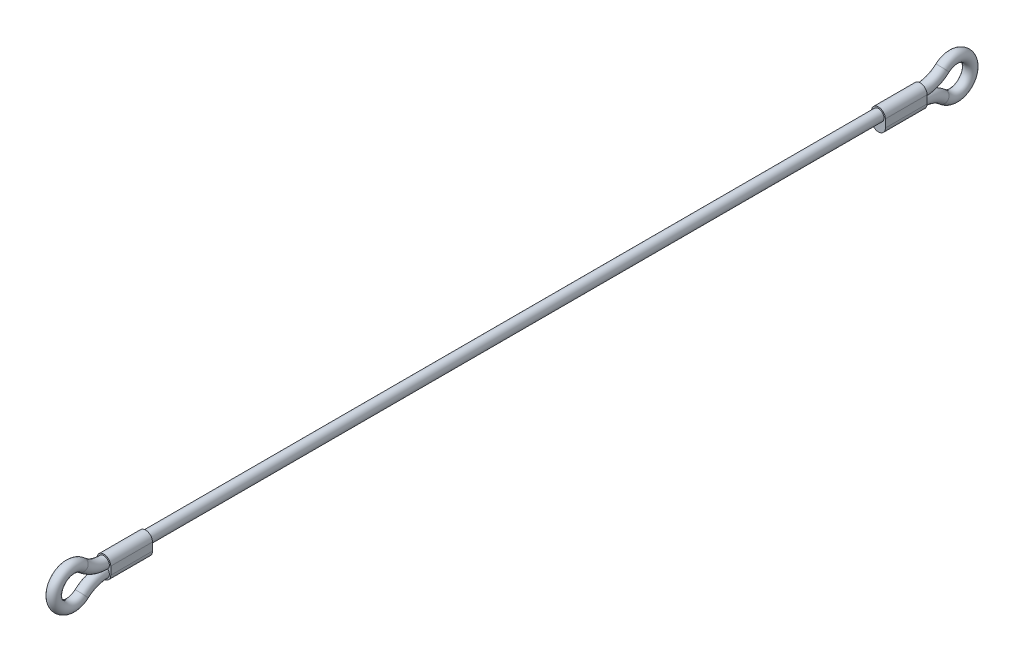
ISO-10303-21;
HEADER;
FILE_DESCRIPTION(('STEP AP214'),'2;1');
FILE_NAME('part.step','',(''),(''),'','','');
FILE_SCHEMA(('AUTOMOTIVE_DESIGN { 1 0 10303 214 1 1 1 1 }'));
ENDSEC;
DATA;
#1=APPLICATION_CONTEXT('core data for automotive mechanical design processes');
#2=APPLICATION_PROTOCOL_DEFINITION('international standard','automotive_design',2000,#1);
#3=PRODUCT_CONTEXT('',#1,'mechanical');
#4=PRODUCT('Part','Part','',(#3));
#5=PRODUCT_RELATED_PRODUCT_CATEGORY('part','',(#4));
#6=PRODUCT_DEFINITION_FORMATION('','',#4);
#7=PRODUCT_DEFINITION_CONTEXT('part definition',#1,'design');
#8=PRODUCT_DEFINITION('design','',#6,#7);
#9=PRODUCT_DEFINITION_SHAPE('','',#8);
#10=(LENGTH_UNIT() NAMED_UNIT(*) SI_UNIT(.MILLI.,.METRE.));
#11=(NAMED_UNIT(*) PLANE_ANGLE_UNIT() SI_UNIT($,.RADIAN.));
#12=(NAMED_UNIT(*) SI_UNIT($,.STERADIAN.) SOLID_ANGLE_UNIT());
#13=UNCERTAINTY_MEASURE_WITH_UNIT(LENGTH_MEASURE(1.E-05),#10,'distance_accuracy_value','');
#14=(GEOMETRIC_REPRESENTATION_CONTEXT(3) GLOBAL_UNCERTAINTY_ASSIGNED_CONTEXT((#13)) GLOBAL_UNIT_ASSIGNED_CONTEXT((#10,
#11,#12)) REPRESENTATION_CONTEXT('',''));
#15=CARTESIAN_POINT('',(0.,0.,0.));
#16=DIRECTION('',(0.,0.,1.));
#17=DIRECTION('',(1.,0.,0.));
#18=AXIS2_PLACEMENT_3D('',#15,#16,#17);
#19=CARTESIAN_POINT('',(0.,0.,-117.4));
#20=DIRECTION('',(0.,0.,1.));
#21=DIRECTION('',(1.,0.,0.));
#22=AXIS2_PLACEMENT_3D('',#19,#20,#21);
#23=CYLINDRICAL_SURFACE('',#22,1.59);
#24=CARTESIAN_POINT('',(0.,0.,-105.4));
#25=DIRECTION('',(0.,0.,1.));
#26=DIRECTION('',(0.,-1.,0.));
#27=AXIS2_PLACEMENT_3D('',#24,#25,#26);
#28=CIRCLE('',#27,1.59);
#29=CARTESIAN_POINT('',(0.,-1.59,-105.4));
#30=VERTEX_POINT('',#29);
#31=EDGE_CURVE('E11',#30,#30,#28,.F.);
#32=ORIENTED_EDGE('',*,*,#31,.F.);
#33=EDGE_LOOP('',(#32));
#34=FACE_BOUND('',#33,.T.);
#35=CARTESIAN_POINT('',(0.,0.,105.4));
#36=DIRECTION('',(0.,0.,-1.));
#37=DIRECTION('',(0.,1.,0.));
#38=AXIS2_PLACEMENT_3D('',#35,#36,#37);
#39=CIRCLE('',#38,1.59);
#40=CARTESIAN_POINT('',(0.,1.59,105.4));
#41=VERTEX_POINT('',#40);
#42=EDGE_CURVE('E51',#41,#41,#39,.F.);
#43=ORIENTED_EDGE('',*,*,#42,.F.);
#44=EDGE_LOOP('',(#43));
#45=FACE_BOUND('',#44,.T.);
#46=ADVANCED_FACE('F41',(#34,#45),#23,.T.);
#47=CARTESIAN_POINT('',(0.,1.15648231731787E-13,105.4));
#48=DIRECTION('',(0.,0.,1.));
#49=DIRECTION('',(0.,-1.,0.));
#50=AXIS2_PLACEMENT_3D('',#47,#48,#49);
#51=CYLINDRICAL_SURFACE('',#50,1.995);
#52=CARTESIAN_POINT('',(0.,1.32995466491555E-13,117.4));
#53=DIRECTION('',(0.,0.,-1.));
#54=DIRECTION('',(0.,1.,0.));
#55=AXIS2_PLACEMENT_3D('',#52,#53,#54);
#56=CIRCLE('',#55,1.995);
#57=CARTESIAN_POINT('',(-1.995,1.33239783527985E-13,117.4));
#58=VERTEX_POINT('',#57);
#59=CARTESIAN_POINT('',(1.995,1.32751149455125E-13,117.4));
#60=VERTEX_POINT('',#59);
#61=EDGE_CURVE('E134',#58,#60,#56,.T.);
#62=ORIENTED_EDGE('',*,*,#61,.T.);
#63=DIRECTION('',(0.,0.,1.));
#64=VECTOR('',#63,1.);
#65=CARTESIAN_POINT('',(1.995,1.15403914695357E-13,105.4));
#66=LINE('',#65,#64);
#67=CARTESIAN_POINT('',(1.995,1.15403914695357E-13,105.4));
#68=VERTEX_POINT('',#67);
#69=EDGE_CURVE('E214',#68,#60,#66,.T.);
#70=ORIENTED_EDGE('',*,*,#69,.F.);
#71=CARTESIAN_POINT('',(0.,1.15648231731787E-13,105.4));
#72=DIRECTION('',(0.,0.,-1.));
#73=DIRECTION('',(0.,1.,0.));
#74=AXIS2_PLACEMENT_3D('',#71,#72,#73);
#75=CIRCLE('',#74,1.995);
#76=CARTESIAN_POINT('',(-1.995,1.15892548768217E-13,105.4));
#77=VERTEX_POINT('',#76);
#78=EDGE_CURVE('E179',#77,#68,#75,.T.);
#79=ORIENTED_EDGE('',*,*,#78,.F.);
#80=DIRECTION('',(0.,0.,1.));
#81=VECTOR('',#80,1.);
#82=CARTESIAN_POINT('',(-1.995,1.15892548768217E-13,105.4));
#83=LINE('',#82,#81);
#84=EDGE_CURVE('E192',#77,#58,#83,.T.);
#85=ORIENTED_EDGE('',*,*,#84,.T.);
#86=EDGE_LOOP('',(#62,#70,#79,#85));
#87=FACE_BOUND('',#86,.T.);
#88=ADVANCED_FACE('F278',(#87),#51,.T.);
#89=CARTESIAN_POINT('',(1.995,1.15403914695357E-13,105.4));
#90=DIRECTION('',(-1.,0.,0.));
#91=DIRECTION('',(0.,0.,1.));
#92=AXIS2_PLACEMENT_3D('',#89,#90,#91);
#93=PLANE('',#92);
#94=DIRECTION('',(0.,-1.,0.));
#95=VECTOR('',#94,1.);
#96=CARTESIAN_POINT('',(1.995,1.32751149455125E-13,117.4));
#97=LINE('',#96,#95);
#98=CARTESIAN_POINT('',(1.995,-2.26625258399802,117.4));
#99=VERTEX_POINT('',#98);
#100=EDGE_CURVE('E196',#60,#99,#97,.T.);
#101=ORIENTED_EDGE('',*,*,#100,.T.);
#102=DIRECTION('',(0.,0.,1.));
#103=VECTOR('',#102,1.);
#104=CARTESIAN_POINT('',(1.995,-2.26625258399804,105.4));
#105=LINE('',#104,#103);
#106=CARTESIAN_POINT('',(1.995,-2.26625258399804,105.4));
#107=VERTEX_POINT('',#106);
#108=EDGE_CURVE('E211',#107,#99,#105,.T.);
#109=ORIENTED_EDGE('',*,*,#108,.F.);
#110=DIRECTION('',(0.,-1.,0.));
#111=VECTOR('',#110,1.);
#112=CARTESIAN_POINT('',(1.995,1.15403914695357E-13,105.4));
#113=LINE('',#112,#111);
#114=EDGE_CURVE('E183',#68,#107,#113,.T.);
#115=ORIENTED_EDGE('',*,*,#114,.F.);
#116=ORIENTED_EDGE('',*,*,#69,.T.);
#117=EDGE_LOOP('',(#101,#109,#115,#116));
#118=FACE_BOUND('',#117,.T.);
#119=ADVANCED_FACE('F283',(#118),#93,.F.);
#120=CARTESIAN_POINT('',(0.,-2.26625258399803,105.4));
#121=DIRECTION('',(0.,0.,1.));
#122=DIRECTION('',(0.,-1.,0.));
#123=AXIS2_PLACEMENT_3D('',#120,#121,#122);
#124=CYLINDRICAL_SURFACE('',#123,1.995);
#125=CARTESIAN_POINT('',(0.,-2.26625258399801,117.4));
#126=DIRECTION('',(0.,0.,-1.));
#127=DIRECTION('',(0.,1.,0.));
#128=AXIS2_PLACEMENT_3D('',#125,#126,#127);
#129=CIRCLE('',#128,1.995);
#130=CARTESIAN_POINT('',(-1.995,-2.26625258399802,117.4));
#131=VERTEX_POINT('',#130);
#132=EDGE_CURVE('E199',#99,#131,#129,.T.);
#133=ORIENTED_EDGE('',*,*,#132,.T.);
#134=DIRECTION('',(0.,0.,1.));
#135=VECTOR('',#134,1.);
#136=CARTESIAN_POINT('',(-1.995,-2.26625258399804,105.4));
#137=LINE('',#136,#135);
#138=CARTESIAN_POINT('',(-1.995,-2.26625258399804,105.4));
#139=VERTEX_POINT('',#138);
#140=EDGE_CURVE('E207',#139,#131,#137,.T.);
#141=ORIENTED_EDGE('',*,*,#140,.F.);
#142=CARTESIAN_POINT('',(0.,-2.26625258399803,105.4));
#143=DIRECTION('',(0.,0.,-1.));
#144=DIRECTION('',(0.,1.,0.));
#145=AXIS2_PLACEMENT_3D('',#142,#143,#144);
#146=CIRCLE('',#145,1.995);
#147=EDGE_CURVE('E187',#107,#139,#146,.T.);
#148=ORIENTED_EDGE('',*,*,#147,.F.);
#149=ORIENTED_EDGE('',*,*,#108,.T.);
#150=EDGE_LOOP('',(#133,#141,#148,#149));
#151=FACE_BOUND('',#150,.T.);
#152=ADVANCED_FACE('F324',(#151),#124,.T.);
#153=CARTESIAN_POINT('',(-1.995,1.15892548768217E-13,105.4));
#154=DIRECTION('',(1.,0.,0.));
#155=DIRECTION('',(0.,1.,0.));
#156=AXIS2_PLACEMENT_3D('',#153,#154,#155);
#157=PLANE('',#156);
#158=DIRECTION('',(0.,1.,0.));
#159=VECTOR('',#158,1.);
#160=CARTESIAN_POINT('',(-1.995,1.33239783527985E-13,117.4));
#161=LINE('',#160,#159);
#162=EDGE_CURVE('E184',#131,#58,#161,.T.);
#163=ORIENTED_EDGE('',*,*,#162,.T.);
#164=ORIENTED_EDGE('',*,*,#84,.F.);
#165=DIRECTION('',(0.,1.,0.));
#166=VECTOR('',#165,1.);
#167=CARTESIAN_POINT('',(-1.995,1.15892548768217E-13,105.4));
#168=LINE('',#167,#166);
#169=EDGE_CURVE('E189',#139,#77,#168,.T.);
#170=ORIENTED_EDGE('',*,*,#169,.F.);
#171=ORIENTED_EDGE('',*,*,#140,.T.);
#172=EDGE_LOOP('',(#163,#164,#170,#171));
#173=FACE_BOUND('',#172,.T.);
#174=ADVANCED_FACE('F320',(#173),#157,.F.);
#175=CARTESIAN_POINT('',(0.,1.15648231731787E-13,105.4));
#176=DIRECTION('',(0.,0.,-1.));
#177=DIRECTION('',(0.,1.,0.));
#178=AXIS2_PLACEMENT_3D('',#175,#176,#177);
#179=PLANE('',#178);
#180=ORIENTED_EDGE('',*,*,#42,.T.);
#181=EDGE_LOOP('',(#180));
#182=FACE_BOUND('',#181,.T.);
#183=ORIENTED_EDGE('',*,*,#78,.T.);
#184=ORIENTED_EDGE('',*,*,#114,.T.);
#185=ORIENTED_EDGE('',*,*,#147,.T.);
#186=ORIENTED_EDGE('',*,*,#169,.T.);
#187=EDGE_LOOP('',(#183,#184,#185,#186));
#188=FACE_BOUND('',#187,.T.);
#189=ADVANCED_FACE('F272',(#182,#188),#179,.T.);
#190=CARTESIAN_POINT('',(0.,1.32995466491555E-13,117.4));
#191=DIRECTION('',(0.,0.,-1.));
#192=DIRECTION('',(0.,1.,0.));
#193=AXIS2_PLACEMENT_3D('',#190,#191,#192);
#194=PLANE('',#193);
#195=CARTESIAN_POINT('',(0.,0.,117.4));
#196=DIRECTION('',(0.,0.,1.));
#197=DIRECTION('',(1.,0.,0.));
#198=AXIS2_PLACEMENT_3D('',#195,#196,#197);
#199=CIRCLE('',#198,1.59);
#200=CARTESIAN_POINT('',(1.1154034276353,-1.13312629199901,117.4));
#201=VERTEX_POINT('',#200);
#202=CARTESIAN_POINT('',(-1.1154034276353,-1.13312629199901,117.4));
#203=VERTEX_POINT('',#202);
#204=EDGE_CURVE('E231',#201,#203,#199,.T.);
#205=ORIENTED_EDGE('',*,*,#204,.F.);
#206=CARTESIAN_POINT('',(0.,-2.26625258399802,117.4));
#207=DIRECTION('',(0.,0.,-1.));
#208=DIRECTION('',(1.,0.,0.));
#209=AXIS2_PLACEMENT_3D('',#206,#207,#208);
#210=CIRCLE('',#209,1.59);
#211=EDGE_CURVE('E64',#201,#203,#210,.T.);
#212=ORIENTED_EDGE('',*,*,#211,.T.);
#213=EDGE_LOOP('',(#205,#212));
#214=FACE_BOUND('',#213,.T.);
#215=ORIENTED_EDGE('',*,*,#61,.F.);
#216=ORIENTED_EDGE('',*,*,#162,.F.);
#217=ORIENTED_EDGE('',*,*,#132,.F.);
#218=ORIENTED_EDGE('',*,*,#100,.F.);
#219=EDGE_LOOP('',(#215,#216,#217,#218));
#220=FACE_BOUND('',#219,.T.);
#221=ADVANCED_FACE('F266',(#214,#220),#194,.F.);
#222=CARTESIAN_POINT('',(0.,-1.13312629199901,127.));
#223=DIRECTION('',(1.,0.,0.));
#224=DIRECTION('',(0.,0.,-1.));
#225=AXIS2_PLACEMENT_3D('',#222,#223,#224);
#226=TOROIDAL_SURFACE('',#225,4.80000000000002,1.59);
#227=CARTESIAN_POINT('',(0.,2.44458247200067,123.8));
#228=DIRECTION('',(0.,0.666666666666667,0.74535599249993));
#229=DIRECTION('',(1.,0.,0.));
#230=AXIS2_PLACEMENT_3D('',#227,#228,#229);
#231=CIRCLE('',#230,1.59);
#232=CARTESIAN_POINT('',(0.,3.62969850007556,122.74));
#233=VERTEX_POINT('',#232);
#234=EDGE_CURVE('E234',#233,#233,#231,.T.);
#235=CARTESIAN_POINT('',(0.,-4.71083505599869,123.8));
#236=DIRECTION('',(0.,0.666666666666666,-0.74535599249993));
#237=DIRECTION('',(1.,0.,0.));
#238=AXIS2_PLACEMENT_3D('',#235,#236,#237);
#239=CIRCLE('',#238,1.59);
#240=CARTESIAN_POINT('',(0.,-5.89595108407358,122.74));
#241=VERTEX_POINT('',#240);
#242=EDGE_CURVE('E238',#241,#241,#239,.T.);
#243=CARTESIAN_POINT('',(0.,-1.13312629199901,127.));
#244=DIRECTION('',(1.,0.,0.));
#245=DIRECTION('',(0.,0.,-1.));
#246=AXIS2_PLACEMENT_3D('',#243,#244,#245);
#247=CIRCLE('',#246,6.39000000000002);
#248=EDGE_CURVE('',#233,#241,#247,.T.);
#249=ORIENTED_EDGE('',*,*,#234,.T.);
#250=ORIENTED_EDGE('',*,*,#242,.F.);
#251=ORIENTED_EDGE('',*,*,#248,.T.);
#252=ORIENTED_EDGE('',*,*,#248,.F.);
#253=EDGE_LOOP('',(#249,#251,#250,#252));
#254=FACE_BOUND('',#253,.T.);
#255=ADVANCED_FACE('F264',(#254),#226,.T.);
#256=CARTESIAN_POINT('',(0.,-11.866252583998,117.4));
#257=DIRECTION('',(-1.,0.,0.));
#258=DIRECTION('',(0.,0.,1.));
#259=AXIS2_PLACEMENT_3D('',#256,#257,#258);
#260=TOROIDAL_SURFACE('',#259,9.59999999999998,1.59);
#261=CARTESIAN_POINT('',(-1.1154034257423,-1.13312629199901,117.3998));
#262=CARTESIAN_POINT('',(-1.11534851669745,-1.13312629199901,117.52773673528));
#263=CARTESIAN_POINT('',(-1.11308141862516,-1.13312629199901,117.655686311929));
#264=CARTESIAN_POINT('',(-1.10371453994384,-1.13312629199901,117.91155828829));
#265=CARTESIAN_POINT('',(-1.09660901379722,-1.13312629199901,118.03948047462));
#266=CARTESIAN_POINT('',(-1.07704253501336,-1.13312629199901,118.296418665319));
#267=CARTESIAN_POINT('',(-1.0645205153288,-1.13312629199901,118.425430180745));
#268=CARTESIAN_POINT('',(-1.03319430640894,-1.13312629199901,118.682627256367));
#269=CARTESIAN_POINT('',(-1.01439338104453,-1.13312629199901,118.810813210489));
#270=CARTESIAN_POINT('',(-0.966908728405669,-1.13312629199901,119.078005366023));
#271=CARTESIAN_POINT('',(-0.937456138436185,-1.13312629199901,119.216883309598));
#272=CARTESIAN_POINT('',(-0.883915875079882,-1.13312629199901,119.42263125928));
#273=CARTESIAN_POINT('',(-0.864530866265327,-1.13312629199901,119.490724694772));
#274=CARTESIAN_POINT('',(-0.821996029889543,-1.13312629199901,119.625715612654));
#275=CARTESIAN_POINT('',(-0.798847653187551,-1.13312629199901,119.692613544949));
#276=CARTESIAN_POINT('',(-0.744519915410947,-1.13312629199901,119.833542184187));
#277=CARTESIAN_POINT('',(-0.712679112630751,-1.13312629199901,119.907321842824));
#278=CARTESIAN_POINT('',(-0.64127940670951,-1.13312629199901,120.051146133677));
#279=CARTESIAN_POINT('',(-0.601727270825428,-1.13312629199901,120.121193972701));
#280=CARTESIAN_POINT('',(-0.528948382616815,-1.13312629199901,120.22943568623));
#281=CARTESIAN_POINT('',(-0.498892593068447,-1.13312629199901,120.269741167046));
#282=CARTESIAN_POINT('',(-0.433770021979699,-1.13312629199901,120.3461405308));
#283=CARTESIAN_POINT('',(-0.398710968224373,-1.13312629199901,120.382240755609));
#284=CARTESIAN_POINT('',(-0.335060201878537,-1.13312629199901,120.437058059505));
#285=CARTESIAN_POINT('',(-0.308066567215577,-1.13312629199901,120.457612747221));
#286=CARTESIAN_POINT('',(-0.251279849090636,-1.13312629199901,120.494433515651));
#287=CARTESIAN_POINT('',(-0.221491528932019,-1.13312629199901,120.510706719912));
#288=CARTESIAN_POINT('',(-0.165682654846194,-1.13312629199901,120.534797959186));
#289=CARTESIAN_POINT('',(-0.140117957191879,-1.13312629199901,120.543660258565));
#290=CARTESIAN_POINT('',(-0.0878641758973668,-1.13312629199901,120.556990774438));
#291=CARTESIAN_POINT('',(-0.0611762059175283,-1.13312629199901,120.561463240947));
#292=CARTESIAN_POINT('',(-0.00731772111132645,-1.13312629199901,120.565572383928));
#293=CARTESIAN_POINT('',(0.0198542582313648,-1.13312629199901,120.565190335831));
#294=CARTESIAN_POINT('',(0.0736951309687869,-1.13312629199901,120.559586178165));
#295=CARTESIAN_POINT('',(0.100363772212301,-1.13312629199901,120.554361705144));
#296=CARTESIAN_POINT('',(0.151195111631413,-1.13312629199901,120.539957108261));
#297=CARTESIAN_POINT('',(0.175416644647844,-1.13312629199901,120.530979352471));
#298=CARTESIAN_POINT('',(0.222373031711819,-1.13312629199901,120.509774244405));
#299=CARTESIAN_POINT('',(0.245107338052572,-1.13312629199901,120.497545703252));
#300=CARTESIAN_POINT('',(0.304759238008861,-1.13312629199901,120.460748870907));
#301=CARTESIAN_POINT('',(0.340101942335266,-1.13312629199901,120.433635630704));
#302=CARTESIAN_POINT('',(0.406281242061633,-1.13312629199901,120.37436880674));
#303=CARTESIAN_POINT('',(0.437102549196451,-1.13312629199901,120.342198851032));
#304=CARTESIAN_POINT('',(0.492718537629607,-1.13312629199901,120.27701365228));
#305=CARTESIAN_POINT('',(0.517788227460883,-1.13312629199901,120.244229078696));
#306=CARTESIAN_POINT('',(0.565060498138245,-1.13312629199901,120.176639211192));
#307=CARTESIAN_POINT('',(0.587260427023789,-1.13312629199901,120.141832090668));
#308=CARTESIAN_POINT('',(0.650275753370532,-1.13312629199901,120.035150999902));
#309=CARTESIAN_POINT('',(0.687428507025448,-1.13312629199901,119.961116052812));
#310=CARTESIAN_POINT('',(0.745434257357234,-1.13312629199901,119.830275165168));
#311=CARTESIAN_POINT('',(0.767985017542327,-1.13312629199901,119.774182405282));
#312=CARTESIAN_POINT('',(0.809859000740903,-1.13312629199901,119.660796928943));
#313=CARTESIAN_POINT('',(0.829181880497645,-1.13312629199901,119.603504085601));
#314=CARTESIAN_POINT('',(0.883166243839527,-1.13312629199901,119.430173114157));
#315=CARTESIAN_POINT('',(0.913763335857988,-1.13312629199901,119.312874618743));
#316=CARTESIAN_POINT('',(0.967023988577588,-1.13312629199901,119.075955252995));
#317=CARTESIAN_POINT('',(0.989647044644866,-1.13312629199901,118.956325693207));
#318=CARTESIAN_POINT('',(1.02845868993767,-1.13312629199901,118.716012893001));
#319=CARTESIAN_POINT('',(1.04464572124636,-1.13312629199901,118.595329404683));
#320=CARTESIAN_POINT('',(1.06818793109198,-1.13312629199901,118.38453669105));
#321=CARTESIAN_POINT('',(1.07674400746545,-1.13312629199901,118.294556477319));
#322=CARTESIAN_POINT('',(1.09119671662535,-1.13312629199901,118.114367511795));
#323=CARTESIAN_POINT('',(1.0970928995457,-1.13312629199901,118.024158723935));
#324=CARTESIAN_POINT('',(1.10635885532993,-1.13312629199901,117.844939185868));
#325=CARTESIAN_POINT('',(1.10976438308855,-1.13312629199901,117.755930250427));
#326=CARTESIAN_POINT('',(1.11428069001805,-1.13312629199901,117.577880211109));
#327=CARTESIAN_POINT('',(1.1153921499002,-1.13312629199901,117.488839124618));
#328=CARTESIAN_POINT('',(1.11540342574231,-1.13312629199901,117.3998));
#329=B_SPLINE_CURVE_WITH_KNOTS('',3,(#261,#262,#263,#264,#265,#266,#267,#268,#269,#270,#271,
#272,#273,#274,#275,#276,#277,#278,#279,#280,#281,#282,#283,#284,#285,#286,#287,#288,#289,#290,
#291,#292,#293,#294,#295,#296,#297,#298,#299,#300,#301,#302,#303,#304,#305,#306,#307,#308,#309,
#310,#311,#312,#313,#314,#315,#316,#317,#318,#319,#320,#321,#322,#323,#324,#325,#326,#327,#328),
.UNSPECIFIED.,.F.,.F.,(4,2,2,2,2,2,2,2,2,2,2,2,2,2,2,2,2,2,2,2,2,2,2,2,2,2,2,2,2,2,2,2,2,4),(0.,
0.383810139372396,0.768076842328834,1.15679365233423,1.54530871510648,1.9707126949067,
2.18302701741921,2.39525968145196,2.6360416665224,2.87661329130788,3.02716706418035,
3.17749076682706,3.2789882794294,3.38031583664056,3.46115731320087,3.54192044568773,
3.62299518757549,3.70410952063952,3.78132200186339,3.85856276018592,3.99142265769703,
4.12472192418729,4.24834991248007,4.37209134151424,4.61994843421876,4.80123584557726,
4.98254252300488,5.34577733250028,5.71083149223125,6.07597396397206,6.34709439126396,
6.61826065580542,6.88545336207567,7.15256677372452),.UNSPECIFIED.);
#330=EDGE_CURVE('E244',#203,#201,#329,.T.);
#331=ORIENTED_EDGE('',*,*,#330,.F.);
#332=ORIENTED_EDGE('',*,*,#211,.F.);
#333=EDGE_LOOP('',(#331,#332));
#334=FACE_BOUND('',#333,.T.);
#335=ORIENTED_EDGE('',*,*,#242,.T.);
#336=EDGE_LOOP('',(#335));
#337=FACE_BOUND('',#336,.T.);
#338=ADVANCED_FACE('F43',(#334,#337),#260,.T.);
#339=CARTESIAN_POINT('',(0.,9.59999999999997,117.4));
#340=DIRECTION('',(-1.,0.,0.));
#341=DIRECTION('',(0.,0.,1.));
#342=AXIS2_PLACEMENT_3D('',#339,#340,#341);
#343=TOROIDAL_SURFACE('',#342,9.59999999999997,1.59);
#344=ORIENTED_EDGE('',*,*,#234,.F.);
#345=EDGE_LOOP('',(#344));
#346=FACE_BOUND('',#345,.T.);
#347=ORIENTED_EDGE('',*,*,#204,.T.);
#348=ORIENTED_EDGE('',*,*,#330,.T.);
#349=EDGE_LOOP('',(#347,#348));
#350=FACE_BOUND('',#349,.T.);
#351=ADVANCED_FACE('F259',(#346,#350),#343,.T.);
#352=CARTESIAN_POINT('',(0.,1.15648231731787E-13,-105.4));
#353=DIRECTION('',(0.,0.,-1.));
#354=DIRECTION('',(0.,1.,0.));
#355=AXIS2_PLACEMENT_3D('',#352,#353,#354);
#356=CYLINDRICAL_SURFACE('',#355,1.995);
#357=CARTESIAN_POINT('',(0.,1.32995466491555E-13,-117.4));
#358=DIRECTION('',(0.,0.,-1.));
#359=DIRECTION('',(0.,1.,0.));
#360=AXIS2_PLACEMENT_3D('',#357,#358,#359);
#361=CIRCLE('',#360,1.995);
#362=CARTESIAN_POINT('',(-1.995,1.33239783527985E-13,-117.4));
#363=VERTEX_POINT('',#362);
#364=CARTESIAN_POINT('',(1.995,1.32751149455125E-13,-117.4));
#365=VERTEX_POINT('',#364);
#366=EDGE_CURVE('E128',#363,#365,#361,.T.);
#367=ORIENTED_EDGE('',*,*,#366,.F.);
#368=DIRECTION('',(0.,0.,-1.));
#369=VECTOR('',#368,1.);
#370=CARTESIAN_POINT('',(-1.995,1.15892548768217E-13,-105.4));
#371=LINE('',#370,#369);
#372=CARTESIAN_POINT('',(-1.995,1.15892548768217E-13,-105.4));
#373=VERTEX_POINT('',#372);
#374=EDGE_CURVE('E122',#373,#363,#371,.T.);
#375=ORIENTED_EDGE('',*,*,#374,.F.);
#376=CARTESIAN_POINT('',(0.,1.15648231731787E-13,-105.4));
#377=DIRECTION('',(0.,0.,-1.));
#378=DIRECTION('',(0.,1.,0.));
#379=AXIS2_PLACEMENT_3D('',#376,#377,#378);
#380=CIRCLE('',#379,1.995);
#381=CARTESIAN_POINT('',(1.995,1.15403914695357E-13,-105.4));
#382=VERTEX_POINT('',#381);
#383=EDGE_CURVE('E125',#373,#382,#380,.T.);
#384=ORIENTED_EDGE('',*,*,#383,.T.);
#385=DIRECTION('',(0.,0.,-1.));
#386=VECTOR('',#385,1.);
#387=CARTESIAN_POINT('',(1.995,1.15403914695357E-13,-105.4));
#388=LINE('',#387,#386);
#389=EDGE_CURVE('E159',#382,#365,#388,.T.);
#390=ORIENTED_EDGE('',*,*,#389,.T.);
#391=EDGE_LOOP('',(#367,#375,#384,#390));
#392=FACE_BOUND('',#391,.T.);
#393=ADVANCED_FACE('F124',(#392),#356,.T.);
#394=CARTESIAN_POINT('',(-1.995,1.15892548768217E-13,-105.4));
#395=DIRECTION('',(-1.,0.,0.));
#396=DIRECTION('',(0.,-1.,0.));
#397=AXIS2_PLACEMENT_3D('',#394,#395,#396);
#398=PLANE('',#397);
#399=DIRECTION('',(0.,1.,0.));
#400=VECTOR('',#399,1.);
#401=CARTESIAN_POINT('',(-1.995,1.33239783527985E-13,-117.4));
#402=LINE('',#401,#400);
#403=CARTESIAN_POINT('',(-1.995,-2.26625258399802,-117.4));
#404=VERTEX_POINT('',#403);
#405=EDGE_CURVE('E162',#404,#363,#402,.T.);
#406=ORIENTED_EDGE('',*,*,#405,.F.);
#407=DIRECTION('',(0.,0.,-1.));
#408=VECTOR('',#407,1.);
#409=CARTESIAN_POINT('',(-1.995,-2.26625258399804,-105.4));
#410=LINE('',#409,#408);
#411=CARTESIAN_POINT('',(-1.995,-2.26625258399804,-105.4));
#412=VERTEX_POINT('',#411);
#413=EDGE_CURVE('E135',#412,#404,#410,.T.);
#414=ORIENTED_EDGE('',*,*,#413,.F.);
#415=DIRECTION('',(0.,1.,0.));
#416=VECTOR('',#415,1.);
#417=CARTESIAN_POINT('',(-1.995,1.15892548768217E-13,-105.4));
#418=LINE('',#417,#416);
#419=EDGE_CURVE('E141',#412,#373,#418,.T.);
#420=ORIENTED_EDGE('',*,*,#419,.T.);
#421=ORIENTED_EDGE('',*,*,#374,.T.);
#422=EDGE_LOOP('',(#406,#414,#420,#421));
#423=FACE_BOUND('',#422,.T.);
#424=ADVANCED_FACE('F148',(#423),#398,.T.);
#425=CARTESIAN_POINT('',(0.,-2.26625258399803,-105.4));
#426=DIRECTION('',(0.,0.,-1.));
#427=DIRECTION('',(0.,1.,0.));
#428=AXIS2_PLACEMENT_3D('',#425,#426,#427);
#429=CYLINDRICAL_SURFACE('',#428,1.995);
#430=CARTESIAN_POINT('',(0.,-2.26625258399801,-117.4));
#431=DIRECTION('',(0.,0.,-1.));
#432=DIRECTION('',(0.,1.,0.));
#433=AXIS2_PLACEMENT_3D('',#430,#431,#432);
#434=CIRCLE('',#433,1.995);
#435=CARTESIAN_POINT('',(1.995,-2.26625258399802,-117.4));
#436=VERTEX_POINT('',#435);
#437=EDGE_CURVE('E165',#436,#404,#434,.T.);
#438=ORIENTED_EDGE('',*,*,#437,.F.);
#439=DIRECTION('',(0.,0.,-1.));
#440=VECTOR('',#439,1.);
#441=CARTESIAN_POINT('',(1.995,-2.26625258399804,-105.4));
#442=LINE('',#441,#440);
#443=CARTESIAN_POINT('',(1.995,-2.26625258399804,-105.4));
#444=VERTEX_POINT('',#443);
#445=EDGE_CURVE('E174',#444,#436,#442,.T.);
#446=ORIENTED_EDGE('',*,*,#445,.F.);
#447=CARTESIAN_POINT('',(0.,-2.26625258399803,-105.4));
#448=DIRECTION('',(0.,0.,-1.));
#449=DIRECTION('',(0.,1.,0.));
#450=AXIS2_PLACEMENT_3D('',#447,#448,#449);
#451=CIRCLE('',#450,1.995);
#452=EDGE_CURVE('E150',#444,#412,#451,.T.);
#453=ORIENTED_EDGE('',*,*,#452,.T.);
#454=ORIENTED_EDGE('',*,*,#413,.T.);
#455=EDGE_LOOP('',(#438,#446,#453,#454));
#456=FACE_BOUND('',#455,.T.);
#457=ADVANCED_FACE('F307',(#456),#429,.T.);
#458=CARTESIAN_POINT('',(1.995,1.15403914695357E-13,-105.4));
#459=DIRECTION('',(1.,0.,0.));
#460=DIRECTION('',(0.,0.,-1.));
#461=AXIS2_PLACEMENT_3D('',#458,#459,#460);
#462=PLANE('',#461);
#463=DIRECTION('',(0.,-1.,0.));
#464=VECTOR('',#463,1.);
#465=CARTESIAN_POINT('',(1.995,1.32751149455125E-13,-117.4));
#466=LINE('',#465,#464);
#467=EDGE_CURVE('E146',#365,#436,#466,.T.);
#468=ORIENTED_EDGE('',*,*,#467,.F.);
#469=ORIENTED_EDGE('',*,*,#389,.F.);
#470=DIRECTION('',(0.,-1.,0.));
#471=VECTOR('',#470,1.);
#472=CARTESIAN_POINT('',(1.995,1.15403914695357E-13,-105.4));
#473=LINE('',#472,#471);
#474=EDGE_CURVE('E144',#382,#444,#473,.T.);
#475=ORIENTED_EDGE('',*,*,#474,.T.);
#476=ORIENTED_EDGE('',*,*,#445,.T.);
#477=EDGE_LOOP('',(#468,#469,#475,#476));
#478=FACE_BOUND('',#477,.T.);
#479=ADVANCED_FACE('F304',(#478),#462,.T.);
#480=CARTESIAN_POINT('',(0.,1.15648231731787E-13,-105.4));
#481=DIRECTION('',(0.,0.,1.));
#482=DIRECTION('',(0.,1.,0.));
#483=AXIS2_PLACEMENT_3D('',#480,#481,#482);
#484=PLANE('',#483);
#485=ORIENTED_EDGE('',*,*,#31,.T.);
#486=EDGE_LOOP('',(#485));
#487=FACE_BOUND('',#486,.T.);
#488=ORIENTED_EDGE('',*,*,#383,.F.);
#489=ORIENTED_EDGE('',*,*,#419,.F.);
#490=ORIENTED_EDGE('',*,*,#452,.F.);
#491=ORIENTED_EDGE('',*,*,#474,.F.);
#492=EDGE_LOOP('',(#488,#489,#490,#491));
#493=FACE_BOUND('',#492,.T.);
#494=ADVANCED_FACE('F139',(#487,#493),#484,.T.);
#495=CARTESIAN_POINT('',(0.,1.32995466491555E-13,-117.4));
#496=DIRECTION('',(0.,0.,1.));
#497=DIRECTION('',(0.,1.,0.));
#498=AXIS2_PLACEMENT_3D('',#495,#496,#497);
#499=PLANE('',#498);
#500=CARTESIAN_POINT('',(0.,-2.26625258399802,-117.4));
#501=DIRECTION('',(0.,0.,-1.));
#502=DIRECTION('',(1.,0.,0.));
#503=AXIS2_PLACEMENT_3D('',#500,#501,#502);
#504=CIRCLE('',#503,1.59);
#505=CARTESIAN_POINT('',(1.1154034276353,-1.13312629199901,-117.4));
#506=VERTEX_POINT('',#505);
#507=CARTESIAN_POINT('',(-1.11540342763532,-1.13312629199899,-117.4));
#508=VERTEX_POINT('',#507);
#509=EDGE_CURVE('E218',#506,#508,#504,.T.);
#510=ORIENTED_EDGE('',*,*,#509,.F.);
#511=CARTESIAN_POINT('',(0.,0.,-117.4));
#512=DIRECTION('',(0.,0.,1.));
#513=DIRECTION('',(1.,0.,0.));
#514=AXIS2_PLACEMENT_3D('',#511,#512,#513);
#515=CIRCLE('',#514,1.59);
#516=EDGE_CURVE('E57',#506,#508,#515,.T.);
#517=ORIENTED_EDGE('',*,*,#516,.T.);
#518=EDGE_LOOP('',(#510,#517));
#519=FACE_BOUND('',#518,.T.);
#520=ORIENTED_EDGE('',*,*,#366,.T.);
#521=ORIENTED_EDGE('',*,*,#467,.T.);
#522=ORIENTED_EDGE('',*,*,#437,.T.);
#523=ORIENTED_EDGE('',*,*,#405,.T.);
#524=EDGE_LOOP('',(#520,#521,#522,#523));
#525=FACE_BOUND('',#524,.T.);
#526=ADVANCED_FACE('F297',(#519,#525),#499,.F.);
#527=CARTESIAN_POINT('',(0.,-1.13312629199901,-127.));
#528=DIRECTION('',(1.,0.,0.));
#529=DIRECTION('',(0.,0.,-1.));
#530=AXIS2_PLACEMENT_3D('',#527,#528,#529);
#531=TOROIDAL_SURFACE('',#530,4.80000000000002,1.59);
#532=CARTESIAN_POINT('',(0.,-4.71083505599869,-123.8));
#533=DIRECTION('',(0.,-0.666666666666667,-0.74535599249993));
#534=DIRECTION('',(1.,0.,0.));
#535=AXIS2_PLACEMENT_3D('',#532,#533,#534);
#536=CIRCLE('',#535,1.59);
#537=CARTESIAN_POINT('',(0.,-5.89595108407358,-122.74));
#538=VERTEX_POINT('',#537);
#539=EDGE_CURVE('E221',#538,#538,#536,.T.);
#540=CARTESIAN_POINT('',(0.,2.44458247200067,-123.8));
#541=DIRECTION('',(0.,-0.666666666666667,0.74535599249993));
#542=DIRECTION('',(1.,0.,0.));
#543=AXIS2_PLACEMENT_3D('',#540,#541,#542);
#544=CIRCLE('',#543,1.59);
#545=CARTESIAN_POINT('',(0.,3.62969850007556,-122.74));
#546=VERTEX_POINT('',#545);
#547=EDGE_CURVE('E225',#546,#546,#544,.T.);
#548=CARTESIAN_POINT('',(0.,-1.13312629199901,-127.));
#549=DIRECTION('',(1.,0.,0.));
#550=DIRECTION('',(0.,0.,-1.));
#551=AXIS2_PLACEMENT_3D('',#548,#549,#550);
#552=CIRCLE('',#551,6.39000000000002);
#553=EDGE_CURVE('',#538,#546,#552,.T.);
#554=ORIENTED_EDGE('',*,*,#539,.T.);
#555=ORIENTED_EDGE('',*,*,#547,.F.);
#556=ORIENTED_EDGE('',*,*,#553,.T.);
#557=ORIENTED_EDGE('',*,*,#553,.F.);
#558=EDGE_LOOP('',(#554,#556,#555,#557));
#559=FACE_BOUND('',#558,.T.);
#560=ADVANCED_FACE('F300',(#559),#531,.T.);
#561=CARTESIAN_POINT('',(0.,9.59999999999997,-117.4));
#562=DIRECTION('',(-1.,0.,0.));
#563=DIRECTION('',(0.,0.,1.));
#564=AXIS2_PLACEMENT_3D('',#561,#562,#563);
#565=TOROIDAL_SURFACE('',#564,9.59999999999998,1.59);
#566=CARTESIAN_POINT('',(-1.1154034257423,-1.13312629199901,-117.3998));
#567=CARTESIAN_POINT('',(-1.11534851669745,-1.13312629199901,-117.52773673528));
#568=CARTESIAN_POINT('',(-1.11308141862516,-1.13312629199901,-117.655686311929));
#569=CARTESIAN_POINT('',(-1.10371453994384,-1.13312629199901,-117.91155828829));
#570=CARTESIAN_POINT('',(-1.09660901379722,-1.13312629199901,-118.03948047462));
#571=CARTESIAN_POINT('',(-1.07704253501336,-1.13312629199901,-118.296418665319));
#572=CARTESIAN_POINT('',(-1.0645205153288,-1.13312629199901,-118.425430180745));
#573=CARTESIAN_POINT('',(-1.03319430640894,-1.13312629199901,-118.682627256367));
#574=CARTESIAN_POINT('',(-1.01439338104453,-1.13312629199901,-118.810813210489));
#575=CARTESIAN_POINT('',(-0.966908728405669,-1.13312629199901,-119.078005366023));
#576=CARTESIAN_POINT('',(-0.937456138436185,-1.13312629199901,-119.216883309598));
#577=CARTESIAN_POINT('',(-0.883915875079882,-1.13312629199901,-119.42263125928));
#578=CARTESIAN_POINT('',(-0.864530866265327,-1.13312629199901,-119.490724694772));
#579=CARTESIAN_POINT('',(-0.821996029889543,-1.13312629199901,-119.625715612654));
#580=CARTESIAN_POINT('',(-0.798847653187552,-1.13312629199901,-119.692613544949));
#581=CARTESIAN_POINT('',(-0.744519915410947,-1.13312629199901,-119.833542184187));
#582=CARTESIAN_POINT('',(-0.71267911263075,-1.13312629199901,-119.907321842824));
#583=CARTESIAN_POINT('',(-0.64127940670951,-1.13312629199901,-120.051146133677));
#584=CARTESIAN_POINT('',(-0.601727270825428,-1.13312629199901,-120.121193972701));
#585=CARTESIAN_POINT('',(-0.528948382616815,-1.13312629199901,-120.22943568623));
#586=CARTESIAN_POINT('',(-0.498892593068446,-1.13312629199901,-120.269741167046));
#587=CARTESIAN_POINT('',(-0.433770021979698,-1.13312629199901,-120.3461405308));
#588=CARTESIAN_POINT('',(-0.398710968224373,-1.13312629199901,-120.382240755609));
#589=CARTESIAN_POINT('',(-0.335060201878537,-1.13312629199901,-120.437058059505));
#590=CARTESIAN_POINT('',(-0.308066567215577,-1.13312629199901,-120.457612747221));
#591=CARTESIAN_POINT('',(-0.251279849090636,-1.13312629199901,-120.494433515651));
#592=CARTESIAN_POINT('',(-0.221491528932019,-1.13312629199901,-120.510706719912));
#593=CARTESIAN_POINT('',(-0.165682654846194,-1.13312629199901,-120.534797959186));
#594=CARTESIAN_POINT('',(-0.140117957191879,-1.13312629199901,-120.543660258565));
#595=CARTESIAN_POINT('',(-0.0878641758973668,-1.13312629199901,-120.556990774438));
#596=CARTESIAN_POINT('',(-0.0611762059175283,-1.13312629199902,-120.561463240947));
#597=CARTESIAN_POINT('',(-0.00731772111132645,-1.13312629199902,-120.565572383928));
#598=CARTESIAN_POINT('',(0.0198542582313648,-1.13312629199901,-120.565190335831));
#599=CARTESIAN_POINT('',(0.0736951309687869,-1.13312629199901,-120.559586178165));
#600=CARTESIAN_POINT('',(0.100363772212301,-1.13312629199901,-120.554361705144));
#601=CARTESIAN_POINT('',(0.151195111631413,-1.13312629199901,-120.539957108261));
#602=CARTESIAN_POINT('',(0.175416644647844,-1.13312629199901,-120.530979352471));
#603=CARTESIAN_POINT('',(0.222373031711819,-1.13312629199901,-120.509774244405));
#604=CARTESIAN_POINT('',(0.245107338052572,-1.13312629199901,-120.497545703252));
#605=CARTESIAN_POINT('',(0.304759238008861,-1.13312629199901,-120.460748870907));
#606=CARTESIAN_POINT('',(0.340101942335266,-1.13312629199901,-120.433635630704));
#607=CARTESIAN_POINT('',(0.406281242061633,-1.13312629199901,-120.37436880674));
#608=CARTESIAN_POINT('',(0.437102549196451,-1.13312629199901,-120.342198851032));
#609=CARTESIAN_POINT('',(0.492718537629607,-1.13312629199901,-120.27701365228));
#610=CARTESIAN_POINT('',(0.517788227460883,-1.13312629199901,-120.244229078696));
#611=CARTESIAN_POINT('',(0.565060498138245,-1.13312629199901,-120.176639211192));
#612=CARTESIAN_POINT('',(0.587260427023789,-1.13312629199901,-120.141832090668));
#613=CARTESIAN_POINT('',(0.650275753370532,-1.13312629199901,-120.035150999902));
#614=CARTESIAN_POINT('',(0.687428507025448,-1.13312629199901,-119.961116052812));
#615=CARTESIAN_POINT('',(0.745434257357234,-1.13312629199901,-119.830275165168));
#616=CARTESIAN_POINT('',(0.767985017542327,-1.13312629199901,-119.774182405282));
#617=CARTESIAN_POINT('',(0.809859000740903,-1.13312629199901,-119.660796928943));
#618=CARTESIAN_POINT('',(0.829181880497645,-1.13312629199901,-119.603504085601));
#619=CARTESIAN_POINT('',(0.883166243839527,-1.13312629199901,-119.430173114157));
#620=CARTESIAN_POINT('',(0.913763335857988,-1.13312629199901,-119.312874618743));
#621=CARTESIAN_POINT('',(0.967023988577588,-1.13312629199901,-119.075955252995));
#622=CARTESIAN_POINT('',(0.989647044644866,-1.13312629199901,-118.956325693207));
#623=CARTESIAN_POINT('',(1.02845868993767,-1.13312629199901,-118.716012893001));
#624=CARTESIAN_POINT('',(1.04464572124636,-1.13312629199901,-118.595329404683));
#625=CARTESIAN_POINT('',(1.06818793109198,-1.13312629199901,-118.38453669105));
#626=CARTESIAN_POINT('',(1.07674400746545,-1.13312629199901,-118.294556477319));
#627=CARTESIAN_POINT('',(1.09119671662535,-1.13312629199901,-118.114367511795));
#628=CARTESIAN_POINT('',(1.0970928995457,-1.13312629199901,-118.024158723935));
#629=CARTESIAN_POINT('',(1.10635885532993,-1.13312629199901,-117.844939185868));
#630=CARTESIAN_POINT('',(1.10976438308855,-1.13312629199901,-117.755930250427));
#631=CARTESIAN_POINT('',(1.11428069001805,-1.13312629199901,-117.577880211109));
#632=CARTESIAN_POINT('',(1.1153921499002,-1.13312629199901,-117.488839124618));
#633=CARTESIAN_POINT('',(1.11540342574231,-1.13312629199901,-117.3998));
#634=B_SPLINE_CURVE_WITH_KNOTS('',3,(#566,#567,#568,#569,#570,#571,#572,#573,#574,#575,#576,
#577,#578,#579,#580,#581,#582,#583,#584,#585,#586,#587,#588,#589,#590,#591,#592,#593,#594,#595,
#596,#597,#598,#599,#600,#601,#602,#603,#604,#605,#606,#607,#608,#609,#610,#611,#612,#613,#614,
#615,#616,#617,#618,#619,#620,#621,#622,#623,#624,#625,#626,#627,#628,#629,#630,#631,#632,#633),
.UNSPECIFIED.,.F.,.F.,(4,2,2,2,2,2,2,2,2,2,2,2,2,2,2,2,2,2,2,2,2,2,2,2,2,2,2,2,2,2,2,2,2,4),(0.,
0.383810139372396,0.768076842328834,1.15679365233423,1.54530871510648,1.9707126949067,
2.18302701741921,2.39525968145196,2.6360416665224,2.87661329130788,3.02716706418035,
3.17749076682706,3.2789882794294,3.38031583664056,3.46115731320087,3.54192044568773,
3.62299518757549,3.70410952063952,3.78132200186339,3.85856276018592,3.99142265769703,
4.12472192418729,4.24834991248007,4.37209134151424,4.61994843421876,4.80123584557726,
4.98254252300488,5.34577733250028,5.71083149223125,6.07597396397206,6.34709439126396,
6.61826065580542,6.88545336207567,7.15256677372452),.UNSPECIFIED.);
#635=EDGE_CURVE('E252',#508,#506,#634,.T.);
#636=ORIENTED_EDGE('',*,*,#635,.F.);
#637=ORIENTED_EDGE('',*,*,#516,.F.);
#638=EDGE_LOOP('',(#636,#637));
#639=FACE_BOUND('',#638,.T.);
#640=ORIENTED_EDGE('',*,*,#547,.T.);
#641=EDGE_LOOP('',(#640));
#642=FACE_BOUND('',#641,.T.);
#643=ADVANCED_FACE('F334',(#639,#642),#565,.T.);
#644=CARTESIAN_POINT('',(0.,-11.866252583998,-117.4));
#645=DIRECTION('',(-1.,0.,0.));
#646=DIRECTION('',(0.,0.,1.));
#647=AXIS2_PLACEMENT_3D('',#644,#645,#646);
#648=TOROIDAL_SURFACE('',#647,9.59999999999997,1.59);
#649=ORIENTED_EDGE('',*,*,#539,.F.);
#650=EDGE_LOOP('',(#649));
#651=FACE_BOUND('',#650,.T.);
#652=ORIENTED_EDGE('',*,*,#509,.T.);
#653=ORIENTED_EDGE('',*,*,#635,.T.);
#654=EDGE_LOOP('',(#652,#653));
#655=FACE_BOUND('',#654,.T.);
#656=ADVANCED_FACE('F295',(#651,#655),#648,.T.);
#657=CLOSED_SHELL('',(#46,#88,#119,#152,#174,#189,#221,#255,#338,#351,#393,#424,#457,#479,#494,
#526,#560,#643,#656));
#658=MANIFOLD_SOLID_BREP('B2',#657);
#659=ADVANCED_BREP_SHAPE_REPRESENTATION('',(#18,#658),#14);
#660=SHAPE_DEFINITION_REPRESENTATION(#9,#659);
ENDSEC;
END-ISO-10303-21;
